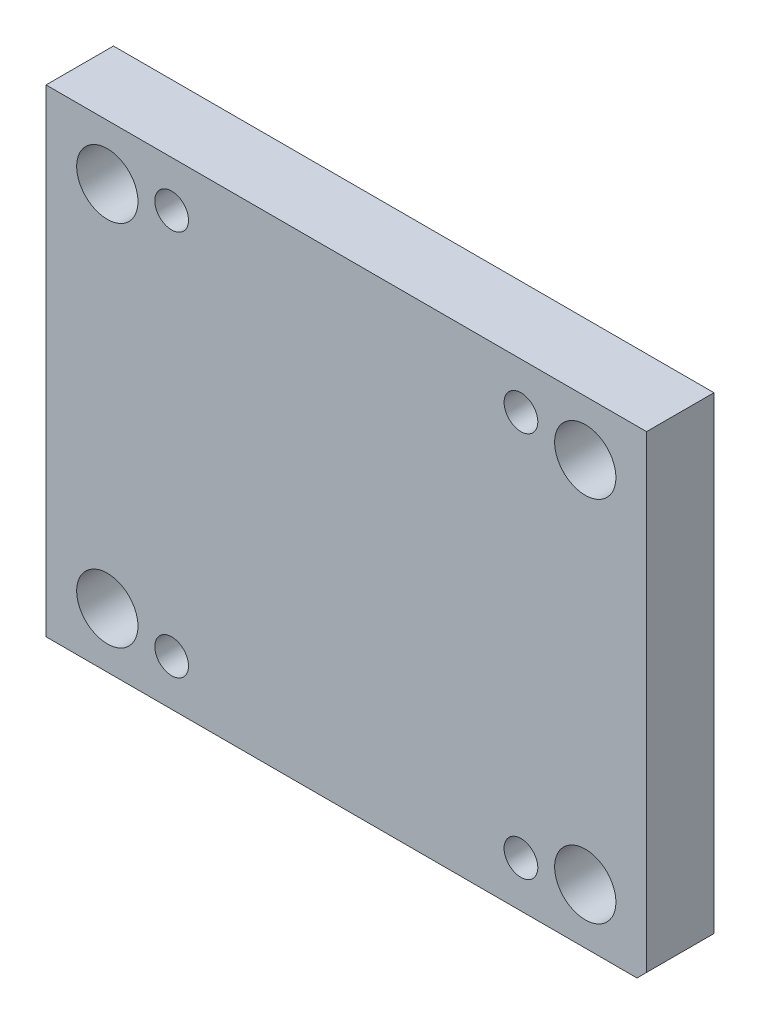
from build123d import *

# Parameters (mm, degrees)
SKETCH1_W            = 196
SKETCH1_H            = 156
BOSS_EXTRUDE1_DEPTH  = 22
DIAMETER_HOLE1_D     = 20
DIAMETER_HOLE1_DEPTH = 22
DIAMETER_HOLE1_TIP   = 6.00860619
HOLE1_D              = 11
HOLE1_CBORE_D        = 18
HOLE1_CBORE_DEPTH    = 13
CHAMFER1_SIZE        = 3.12
SKETCH6_R            = 45
CUT_EXTRUDE1_DEPTH   = 4.05


with BuildPart() as part:
    # Sketch1 → Boss-Extrude1 (new body)
    with BuildSketch(Plane.XY):
        Rectangle(SKETCH1_W, SKETCH1_H)
    extrude(amount=-BOSS_EXTRUDE1_DEPTH)

    # Diameter Hole1
    with Locations(Plane(origin=(-522.991452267, 0, 0), x_dir=(1, 0, 0), z_dir=(0, 0, 1))):
        with Locations((600.991452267, 60), (600.991452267, -60), (444.991452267, -60), (444.991452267, 60)):
            Hole(DIAMETER_HOLE1_D / 2, depth=DIAMETER_HOLE1_DEPTH)
            with Locations((0, 0, -(DIAMETER_HOLE1_DEPTH + DIAMETER_HOLE1_TIP / 2))):  # 118° drill point
                Cone(0, DIAMETER_HOLE1_D / 2, DIAMETER_HOLE1_TIP, mode=Mode.SUBTRACT)

    # Hole1 (through all)
    with Locations(Plane(origin=(0, 0, -22), x_dir=(1, 0, 0), z_dir=(0, 0, -1))):
        with Locations((57, -63), (57, 63), (-57, 63), (-57, -63)):
            CounterBoreHole(HOLE1_D / 2, HOLE1_CBORE_D / 2, HOLE1_CBORE_DEPTH)

    # Chamfer1
    chamfer1_edges = [part.edges().sort_by_distance(p)[0] for p in [
        (98, -78, -11),
    ]]
    chamfer(chamfer1_edges, length=CHAMFER1_SIZE)

    # Sketch6 → Cut-Extrude1 (cut)
    with BuildSketch(Plane.XY.offset(-22)):
        Circle(SKETCH6_R)
    extrude(amount=CUT_EXTRUDE1_DEPTH, mode=Mode.SUBTRACT)


solid = part.part
